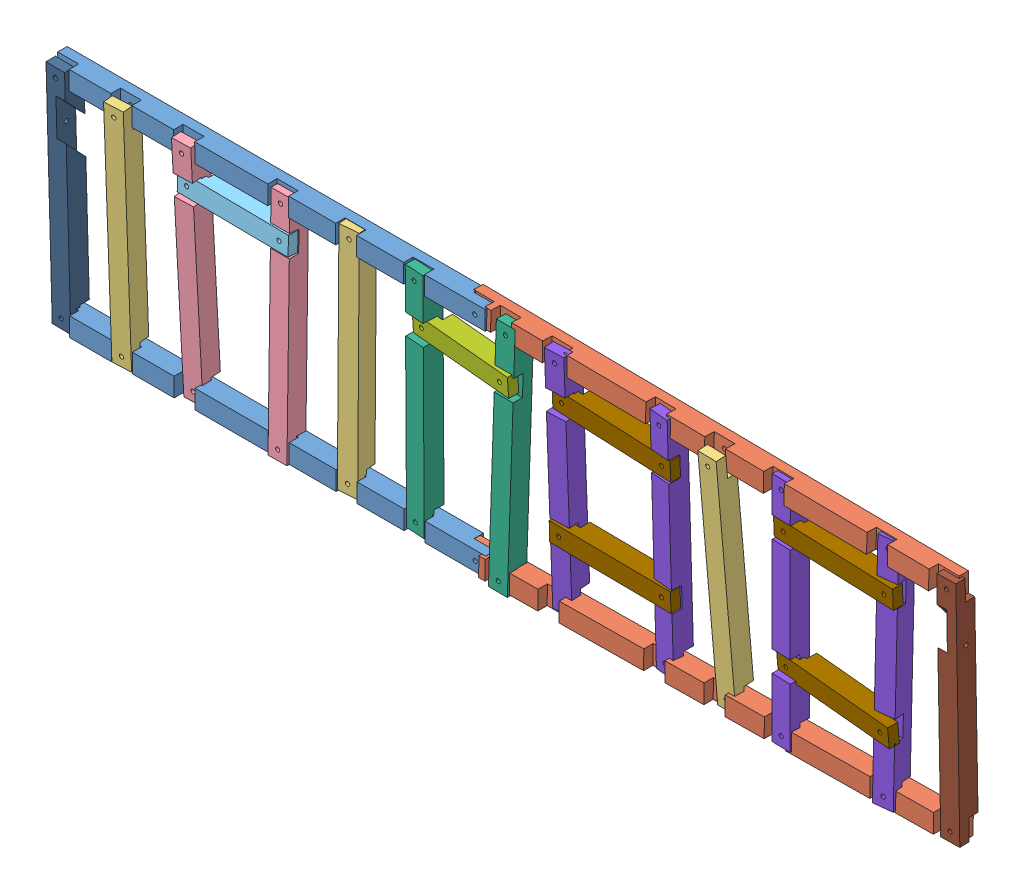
SolidWorks assembly Assemblage_AV_notes.SLDASM, configuration Défaut (file format 3400). Lengths in mm.
Overall size (434.78 112.5 19.3).
23 component instances, 11 part files, 0 mates.
Components (placement in the parent):
- Base_G-AV-1: Base_G-AV.SLDPRT [Défaut] at (-110.8161 -25.5826 3.0751) size (209 9 9)
- Base_G-AV-2: Base_G-AV.SLDPRT [Défaut] at (-110.8715 76.586 3.2289) size (209 9 9)
- Base_D-AV-1: Base_D-AV.SLDPRT [Défaut] at (87.1977 76.6124 2.4605) x (0.999931 0.000601 0.011708) z (-0.011718 0.020718 0.999717) size (235 9 9)
- Base_D-AV-2: Base_D-AV.SLDPRT [Défaut] at (86.3066 -25.6939 4.7573) x (0.999931 -0.000494 -0.011732) z (0.011736 0.010297 0.999878) size (235 9 9)
- montant-1: montant.SLDPRT [Default] at (-180.5636 17.55 19.1161) x (-0.001336 -0.999292 -0.037602) z (-0.049357 0.037622 -0.998072) size (110 9 9)
- montant-2: montant.SLDPRT [Default] at (316.0851 42.1966 17.8366) x (-0.004468 0.996596 0.08232) z (0.023822 0.082403 -0.996314) size (110 9 9)
- montant-3: montant.SLDPRT [Default] at (136.5542 42.6524 2.5669) x (0.000259 0.999978 -0.006578) z (-0.083118 -0.006534 -0.996518) size (110 9 9)
- montant_3-4-1: montant_3-4.SLDPRT [Default] at (-106.0703 16.2759 12.4071) x (0.002122 -0.999879 0.01538) z (-0.004429 -0.015389 -0.999872) size (110 9 9)
- montant_3-4-2: montant_3-4.SLDPRT [Default] at (-149.8924 16.4017 13.6541) x (0.004288 -0.998764 -0.049511) z (-0.0242 0.049393 -0.998486) size (110 9 9)
- traverse_T1-1: traverse_T1.SLDPRT [Défaut] at (-50.0928 68.8654 11.16) x (0.999821 0.006047 0.017918) z (0.018053 -0.023077 -0.999571) size (54 9 9)
- montant_6-7-1: montant_6-7.SLDPRT [Default] at (1.6602 17.4904 13.5063) x (-0.00909 -0.999639 0.025276) z (-0.001816 -0.02526 -0.999679) size (110 9 9)
- montant_6-7-2: montant_6-7.SLDPRT [Default] at (-41.0756 18.5591 5.5097) x (-0.005763 -0.999918 -0.011443) z (0.058023 0.01109 -0.998254) size (110 9 9)
- traverse_T2-1: traverse_T2.SLDPRT [Défaut] at (60.8773 64.9511 9.8675) x (0.996278 -0.004979 0.08605) z (0.086192 0.065415 -0.994129) size (50 9 9)
- montant_T3-1: montant_T3.SLDPRT [Default] at (77.2686 18.7415 2.7682) x (-0.006691 -0.99937 -0.034863) z (0.081488 0.034203 -0.996087) size (110 9 9)
- montant_T3-2: montant_T3.SLDPRT [Default] at (27.5773 18.2825 15.1661) x (0.000597 -0.999343 -0.036231) z (-0.03683 0.036185 -0.998666) size (110 9 9)
- traverse_T3-1: traverse_T3.SLDPRT [Défaut] at (234.5317 10.9455 9.2261) x (0.995398 0.003735 0.095758) z (0.095211 0.074949 -0.992632) size (59 9 9)
- traverse_T3-2: traverse_T3.SLDPRT [Défaut] at (293.6902 58.8542 12.5497) x (-0.999407 0.003553 -0.034235) z (0.03436 0.045015 -0.998395) size (59 9 9)
- traverse_T3-3: traverse_T3.SLDPRT [Défaut] at (127.8701 12.6374 11.3566) x (0.999846 0.005976 0.016475) z (0.016346 0.02103 -0.999645) size (59 9 9)
- traverse_T3-4: traverse_T3.SLDPRT [Défaut] at (128.5662 68.0188 10.6199) x (0.999049 -0.001077 0.043598) z (0.043608 0.036267 -0.99839) size (59 9 9)
- montant_T3-3: montant_T3.SLDPRT [Default] at (184.7268 18.1281 24.044) x (0.001847 -0.999665 0.025808) z (-0.114227 -0.02585 -0.993118) size (110 9 9)
- montant_T3-4: montant_T3.SLDPRT [Default] at (134.2693 16.9427 8.082) x (0.009085 -0.999909 0.009923) z (0.036114 -0.009589 -0.999302) size (110 9 9)
- montant_1-1: montant_1.SLDPRT [Default] at (-1.4118 41.4337 13.6128) x (-0.000138 0.999636 0.026995) z (0.014592 0.026994 -0.999529) size (110 9 9)
- montant13-30-1: montant13-30.SLDPRT [Default] at (424.2608 42.2621 10.3838) x (-0.001463 0.999872 0.015903) z (-0.014868 0.01588 -0.999763) size (110 9 9)
